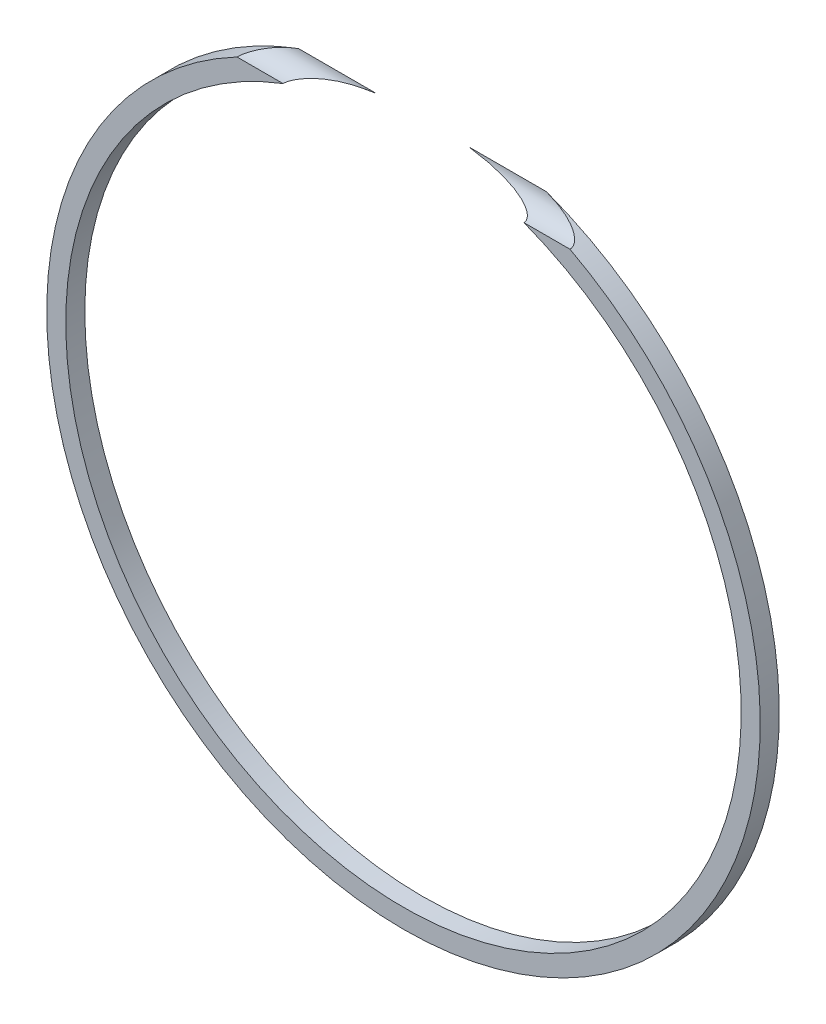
from build123d import *

# Parameters (mm, degrees)
ESQUISSE1_R                  = 22.5
ESQUISSE1_R_2                = 21.3
BOSS_EXTRU_1_DEPTH           = 1.2
ENL_V_MAT_EXTRU_1_DEPTH      = 32.842424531
ENL_V_MAT_EXTRU_1_DEPTH_BACK = 32.842424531


with BuildPart() as part:
    # Esquisse1 → Boss.-Extru.1 (new body)
    with BuildSketch(Plane.XY):
        Circle(ESQUISSE1_R)
        Circle(ESQUISSE1_R_2, mode=Mode.SUBTRACT)
    extrude(amount=BOSS_EXTRU_1_DEPTH)

    # Esquisse3 → Enl_v. mat.-Extru.1 (cut, two sides: drawn at the far end of the back side and taken through both)
    with BuildSketch(Plane(origin=(0, 0, 0), x_dir=(0, 0, -1), z_dir=(1, 0, 0)).offset(-ENL_V_MAT_EXTRU_1_DEPTH_BACK)):
        with BuildLine():
            Line((0, 21.099748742), (0, 23.443163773))
            Line((0, 23.443163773), (-4.466583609, 23.443163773))
            Line((-4.466583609, 23.443163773), (-2.383043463, 21.300766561))
            ThreePointArc((-2.383043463, 21.300766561), (-1.300865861, 19.90399539), (0, 21.099748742))
        make_face()
    extrude(amount=ENL_V_MAT_EXTRU_1_DEPTH + ENL_V_MAT_EXTRU_1_DEPTH_BACK, mode=Mode.SUBTRACT)


solid = part.part
